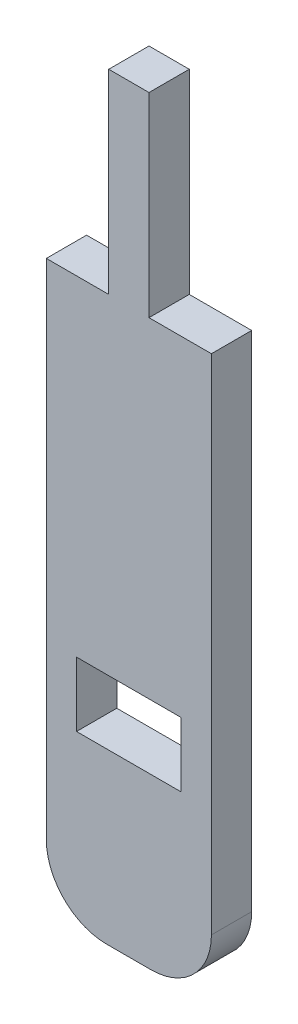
ISO-10303-21;
HEADER;
FILE_DESCRIPTION(('STEP AP214'),'2;1');
FILE_NAME('part.step','',(''),(''),'','','');
FILE_SCHEMA(('AUTOMOTIVE_DESIGN { 1 0 10303 214 1 1 1 1 }'));
ENDSEC;
DATA;
#1=APPLICATION_CONTEXT('core data for automotive mechanical design processes');
#2=APPLICATION_PROTOCOL_DEFINITION('international standard','automotive_design',2000,#1);
#3=PRODUCT_CONTEXT('',#1,'mechanical');
#4=PRODUCT('Part','Part','',(#3));
#5=PRODUCT_RELATED_PRODUCT_CATEGORY('part','',(#4));
#6=PRODUCT_DEFINITION_FORMATION('','',#4);
#7=PRODUCT_DEFINITION_CONTEXT('part definition',#1,'design');
#8=PRODUCT_DEFINITION('design','',#6,#7);
#9=PRODUCT_DEFINITION_SHAPE('','',#8);
#10=(LENGTH_UNIT() NAMED_UNIT(*) SI_UNIT(.MILLI.,.METRE.));
#11=(NAMED_UNIT(*) PLANE_ANGLE_UNIT() SI_UNIT($,.RADIAN.));
#12=(NAMED_UNIT(*) SI_UNIT($,.STERADIAN.) SOLID_ANGLE_UNIT());
#13=UNCERTAINTY_MEASURE_WITH_UNIT(LENGTH_MEASURE(1.E-05),#10,'distance_accuracy_value','');
#14=(GEOMETRIC_REPRESENTATION_CONTEXT(3) GLOBAL_UNCERTAINTY_ASSIGNED_CONTEXT((#13)) GLOBAL_UNIT_ASSIGNED_CONTEXT((#10,
#11,#12)) REPRESENTATION_CONTEXT('',''));
#15=CARTESIAN_POINT('',(0.,0.,0.));
#16=DIRECTION('',(0.,0.,1.));
#17=DIRECTION('',(1.,0.,0.));
#18=AXIS2_PLACEMENT_3D('',#15,#16,#17);
#19=CARTESIAN_POINT('',(-4.1,0.,2.));
#20=DIRECTION('',(1.,0.,0.));
#21=DIRECTION('',(0.,0.,-1.));
#22=AXIS2_PLACEMENT_3D('',#19,#20,#21);
#23=PLANE('',#22);
#24=DIRECTION('',(0.,-1.,0.));
#25=VECTOR('',#24,1.);
#26=CARTESIAN_POINT('',(-4.1,0.,0.));
#27=LINE('',#26,#25);
#28=CARTESIAN_POINT('',(-4.1,18.,0.));
#29=VERTEX_POINT('',#28);
#30=CARTESIAN_POINT('',(-4.1,-7.,0.));
#31=VERTEX_POINT('',#30);
#32=EDGE_CURVE('E186',#29,#31,#27,.T.);
#33=ORIENTED_EDGE('',*,*,#32,.T.);
#34=DIRECTION('',(0.,0.,-1.));
#35=VECTOR('',#34,1.);
#36=CARTESIAN_POINT('',(-4.1,-7.,2.));
#37=LINE('',#36,#35);
#38=CARTESIAN_POINT('',(-4.1,-7.,2.));
#39=VERTEX_POINT('',#38);
#40=EDGE_CURVE('E11',#39,#31,#37,.T.);
#41=ORIENTED_EDGE('',*,*,#40,.F.);
#42=DIRECTION('',(0.,-1.,0.));
#43=VECTOR('',#42,1.);
#44=CARTESIAN_POINT('',(-4.1,0.,2.));
#45=LINE('',#44,#43);
#46=CARTESIAN_POINT('',(-4.1,18.,2.));
#47=VERTEX_POINT('',#46);
#48=EDGE_CURVE('E299',#47,#39,#45,.T.);
#49=ORIENTED_EDGE('',*,*,#48,.F.);
#50=DIRECTION('',(0.,0.,-1.));
#51=VECTOR('',#50,1.);
#52=CARTESIAN_POINT('',(-4.1,18.,2.));
#53=LINE('',#52,#51);
#54=EDGE_CURVE('E54',#47,#29,#53,.T.);
#55=ORIENTED_EDGE('',*,*,#54,.T.);
#56=EDGE_LOOP('',(#33,#41,#49,#55));
#57=FACE_BOUND('',#56,.T.);
#58=ADVANCED_FACE('F35',(#57),#23,.F.);
#59=CARTESIAN_POINT('',(-1.1,-7.,2.));
#60=DIRECTION('',(0.,0.,-1.));
#61=DIRECTION('',(-1.,0.,0.));
#62=AXIS2_PLACEMENT_3D('',#59,#60,#61);
#63=CYLINDRICAL_SURFACE('',#62,3.);
#64=CARTESIAN_POINT('',(-1.1,-7.,0.));
#65=DIRECTION('',(0.,0.,1.));
#66=DIRECTION('',(1.,0.,0.));
#67=AXIS2_PLACEMENT_3D('',#64,#65,#66);
#68=CIRCLE('',#67,3.);
#69=CARTESIAN_POINT('',(-1.1,-10.,0.));
#70=VERTEX_POINT('',#69);
#71=EDGE_CURVE('E188',#31,#70,#68,.T.);
#72=ORIENTED_EDGE('',*,*,#71,.T.);
#73=DIRECTION('',(0.,0.,-1.));
#74=VECTOR('',#73,1.);
#75=CARTESIAN_POINT('',(-1.1,-10.,2.));
#76=LINE('',#75,#74);
#77=CARTESIAN_POINT('',(-1.1,-10.,2.));
#78=VERTEX_POINT('',#77);
#79=EDGE_CURVE('E45',#78,#70,#76,.T.);
#80=ORIENTED_EDGE('',*,*,#79,.F.);
#81=CARTESIAN_POINT('',(-1.1,-7.,2.));
#82=DIRECTION('',(0.,0.,1.));
#83=DIRECTION('',(1.,0.,0.));
#84=AXIS2_PLACEMENT_3D('',#81,#82,#83);
#85=CIRCLE('',#84,3.);
#86=EDGE_CURVE('E301',#39,#78,#85,.T.);
#87=ORIENTED_EDGE('',*,*,#86,.F.);
#88=ORIENTED_EDGE('',*,*,#40,.T.);
#89=EDGE_LOOP('',(#72,#80,#87,#88));
#90=FACE_BOUND('',#89,.T.);
#91=ADVANCED_FACE('F254',(#90),#63,.T.);
#92=CARTESIAN_POINT('',(0.,-10.,2.));
#93=DIRECTION('',(0.,1.,0.));
#94=DIRECTION('',(0.,0.,1.));
#95=AXIS2_PLACEMENT_3D('',#92,#93,#94);
#96=PLANE('',#95);
#97=DIRECTION('',(1.,0.,0.));
#98=VECTOR('',#97,1.);
#99=CARTESIAN_POINT('',(0.,-10.,0.));
#100=LINE('',#99,#98);
#101=CARTESIAN_POINT('',(1.1,-10.,0.));
#102=VERTEX_POINT('',#101);
#103=EDGE_CURVE('E190',#70,#102,#100,.T.);
#104=ORIENTED_EDGE('',*,*,#103,.T.);
#105=DIRECTION('',(0.,0.,-1.));
#106=VECTOR('',#105,1.);
#107=CARTESIAN_POINT('',(1.1,-10.,2.));
#108=LINE('',#107,#106);
#109=CARTESIAN_POINT('',(1.1,-10.,2.));
#110=VERTEX_POINT('',#109);
#111=EDGE_CURVE('E218',#110,#102,#108,.T.);
#112=ORIENTED_EDGE('',*,*,#111,.F.);
#113=DIRECTION('',(1.,0.,0.));
#114=VECTOR('',#113,1.);
#115=CARTESIAN_POINT('',(0.,-10.,2.));
#116=LINE('',#115,#114);
#117=EDGE_CURVE('E303',#78,#110,#116,.T.);
#118=ORIENTED_EDGE('',*,*,#117,.F.);
#119=ORIENTED_EDGE('',*,*,#79,.T.);
#120=EDGE_LOOP('',(#104,#112,#118,#119));
#121=FACE_BOUND('',#120,.T.);
#122=ADVANCED_FACE('F259',(#121),#96,.F.);
#123=CARTESIAN_POINT('',(1.1,-7.,2.));
#124=DIRECTION('',(0.,0.,-1.));
#125=DIRECTION('',(-1.,0.,0.));
#126=AXIS2_PLACEMENT_3D('',#123,#124,#125);
#127=CYLINDRICAL_SURFACE('',#126,3.);
#128=CARTESIAN_POINT('',(1.1,-7.,0.));
#129=DIRECTION('',(0.,0.,1.));
#130=DIRECTION('',(1.,0.,0.));
#131=AXIS2_PLACEMENT_3D('',#128,#129,#130);
#132=CIRCLE('',#131,3.);
#133=CARTESIAN_POINT('',(4.1,-7.,0.));
#134=VERTEX_POINT('',#133);
#135=EDGE_CURVE('E193',#134,#102,#132,.F.);
#136=ORIENTED_EDGE('',*,*,#135,.F.);
#137=DIRECTION('',(0.,0.,-1.));
#138=VECTOR('',#137,1.);
#139=CARTESIAN_POINT('',(4.1,-7.,2.));
#140=LINE('',#139,#138);
#141=CARTESIAN_POINT('',(4.1,-7.,2.));
#142=VERTEX_POINT('',#141);
#143=EDGE_CURVE('E216',#142,#134,#140,.T.);
#144=ORIENTED_EDGE('',*,*,#143,.F.);
#145=CARTESIAN_POINT('',(1.1,-7.,2.));
#146=DIRECTION('',(0.,0.,1.));
#147=DIRECTION('',(1.,0.,0.));
#148=AXIS2_PLACEMENT_3D('',#145,#146,#147);
#149=CIRCLE('',#148,3.);
#150=EDGE_CURVE('E305',#142,#110,#149,.F.);
#151=ORIENTED_EDGE('',*,*,#150,.T.);
#152=ORIENTED_EDGE('',*,*,#111,.T.);
#153=EDGE_LOOP('',(#136,#144,#151,#152));
#154=FACE_BOUND('',#153,.T.);
#155=ADVANCED_FACE('F265',(#154),#127,.T.);
#156=CARTESIAN_POINT('',(4.1,0.,2.));
#157=DIRECTION('',(-1.,0.,0.));
#158=DIRECTION('',(0.,0.,1.));
#159=AXIS2_PLACEMENT_3D('',#156,#157,#158);
#160=PLANE('',#159);
#161=DIRECTION('',(0.,1.,0.));
#162=VECTOR('',#161,1.);
#163=CARTESIAN_POINT('',(4.1,0.,0.));
#164=LINE('',#163,#162);
#165=CARTESIAN_POINT('',(4.1,18.,0.));
#166=VERTEX_POINT('',#165);
#167=EDGE_CURVE('E196',#134,#166,#164,.T.);
#168=ORIENTED_EDGE('',*,*,#167,.T.);
#169=DIRECTION('',(0.,0.,-1.));
#170=VECTOR('',#169,1.);
#171=CARTESIAN_POINT('',(4.1,18.,2.));
#172=LINE('',#171,#170);
#173=CARTESIAN_POINT('',(4.1,18.,2.));
#174=VERTEX_POINT('',#173);
#175=EDGE_CURVE('E214',#174,#166,#172,.T.);
#176=ORIENTED_EDGE('',*,*,#175,.F.);
#177=DIRECTION('',(0.,1.,0.));
#178=VECTOR('',#177,1.);
#179=CARTESIAN_POINT('',(4.1,0.,2.));
#180=LINE('',#179,#178);
#181=EDGE_CURVE('E308',#142,#174,#180,.T.);
#182=ORIENTED_EDGE('',*,*,#181,.F.);
#183=ORIENTED_EDGE('',*,*,#143,.T.);
#184=EDGE_LOOP('',(#168,#176,#182,#183));
#185=FACE_BOUND('',#184,.T.);
#186=ADVANCED_FACE('F269',(#185),#160,.F.);
#187=CARTESIAN_POINT('',(0.,18.,2.));
#188=DIRECTION('',(0.,1.,0.));
#189=DIRECTION('',(0.,0.,1.));
#190=AXIS2_PLACEMENT_3D('',#187,#188,#189);
#191=PLANE('',#190);
#192=DIRECTION('',(1.,0.,0.));
#193=VECTOR('',#192,1.);
#194=CARTESIAN_POINT('',(0.,18.,0.));
#195=LINE('',#194,#193);
#196=CARTESIAN_POINT('',(1.,18.,0.));
#197=VERTEX_POINT('',#196);
#198=EDGE_CURVE('E199',#197,#166,#195,.T.);
#199=ORIENTED_EDGE('',*,*,#198,.F.);
#200=DIRECTION('',(0.,0.,-1.));
#201=VECTOR('',#200,1.);
#202=CARTESIAN_POINT('',(1.,18.,2.));
#203=LINE('',#202,#201);
#204=CARTESIAN_POINT('',(1.,18.,2.));
#205=VERTEX_POINT('',#204);
#206=EDGE_CURVE('E212',#205,#197,#203,.T.);
#207=ORIENTED_EDGE('',*,*,#206,.F.);
#208=DIRECTION('',(1.,0.,0.));
#209=VECTOR('',#208,1.);
#210=CARTESIAN_POINT('',(0.,18.,2.));
#211=LINE('',#210,#209);
#212=EDGE_CURVE('E170',#205,#174,#211,.T.);
#213=ORIENTED_EDGE('',*,*,#212,.T.);
#214=ORIENTED_EDGE('',*,*,#175,.T.);
#215=EDGE_LOOP('',(#199,#207,#213,#214));
#216=FACE_BOUND('',#215,.T.);
#217=ADVANCED_FACE('F273',(#216),#191,.T.);
#218=CARTESIAN_POINT('',(1.,0.,2.));
#219=DIRECTION('',(1.,0.,0.));
#220=DIRECTION('',(0.,1.,0.));
#221=AXIS2_PLACEMENT_3D('',#218,#219,#220);
#222=PLANE('',#221);
#223=DIRECTION('',(0.,-1.,0.));
#224=VECTOR('',#223,1.);
#225=CARTESIAN_POINT('',(1.,0.,0.));
#226=LINE('',#225,#224);
#227=CARTESIAN_POINT('',(0.999999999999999,27.6857443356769,0.));
#228=VERTEX_POINT('',#227);
#229=EDGE_CURVE('E202',#228,#197,#226,.T.);
#230=ORIENTED_EDGE('',*,*,#229,.F.);
#231=DIRECTION('',(0.,0.,-1.));
#232=VECTOR('',#231,1.);
#233=CARTESIAN_POINT('',(0.999999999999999,27.6857443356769,2.));
#234=LINE('',#233,#232);
#235=CARTESIAN_POINT('',(0.999999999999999,27.6857443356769,2.));
#236=VERTEX_POINT('',#235);
#237=EDGE_CURVE('E155',#236,#228,#234,.T.);
#238=ORIENTED_EDGE('',*,*,#237,.F.);
#239=DIRECTION('',(0.,-1.,0.));
#240=VECTOR('',#239,1.);
#241=CARTESIAN_POINT('',(1.,0.,2.));
#242=LINE('',#241,#240);
#243=EDGE_CURVE('E168',#236,#205,#242,.T.);
#244=ORIENTED_EDGE('',*,*,#243,.T.);
#245=ORIENTED_EDGE('',*,*,#206,.T.);
#246=EDGE_LOOP('',(#230,#238,#244,#245));
#247=FACE_BOUND('',#246,.T.);
#248=ADVANCED_FACE('F275',(#247),#222,.T.);
#249=CARTESIAN_POINT('',(0.,27.6857443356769,2.));
#250=DIRECTION('',(0.,1.,0.));
#251=DIRECTION('',(0.,0.,1.));
#252=AXIS2_PLACEMENT_3D('',#249,#250,#251);
#253=PLANE('',#252);
#254=DIRECTION('',(1.,0.,0.));
#255=VECTOR('',#254,1.);
#256=CARTESIAN_POINT('',(0.,27.6857443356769,0.));
#257=LINE('',#256,#255);
#258=CARTESIAN_POINT('',(-0.999999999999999,27.6857443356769,0.));
#259=VERTEX_POINT('',#258);
#260=EDGE_CURVE('E152',#259,#228,#257,.T.);
#261=ORIENTED_EDGE('',*,*,#260,.F.);
#262=DIRECTION('',(0.,0.,-1.));
#263=VECTOR('',#262,1.);
#264=CARTESIAN_POINT('',(-0.999999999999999,27.6857443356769,2.));
#265=LINE('',#264,#263);
#266=CARTESIAN_POINT('',(-0.999999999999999,27.6857443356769,2.));
#267=VERTEX_POINT('',#266);
#268=EDGE_CURVE('E146',#267,#259,#265,.T.);
#269=ORIENTED_EDGE('',*,*,#268,.F.);
#270=DIRECTION('',(1.,0.,0.));
#271=VECTOR('',#270,1.);
#272=CARTESIAN_POINT('',(0.,27.6857443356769,2.));
#273=LINE('',#272,#271);
#274=EDGE_CURVE('E150',#267,#236,#273,.T.);
#275=ORIENTED_EDGE('',*,*,#274,.T.);
#276=ORIENTED_EDGE('',*,*,#237,.T.);
#277=EDGE_LOOP('',(#261,#269,#275,#276));
#278=FACE_BOUND('',#277,.T.);
#279=ADVANCED_FACE('F148',(#278),#253,.T.);
#280=CARTESIAN_POINT('',(-1.,0.,2.));
#281=DIRECTION('',(1.,0.,0.));
#282=DIRECTION('',(0.,1.,0.));
#283=AXIS2_PLACEMENT_3D('',#280,#281,#282);
#284=PLANE('',#283);
#285=DIRECTION('',(0.,-1.,0.));
#286=VECTOR('',#285,1.);
#287=CARTESIAN_POINT('',(-1.,0.,0.));
#288=LINE('',#287,#286);
#289=CARTESIAN_POINT('',(-0.999999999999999,18.,0.));
#290=VERTEX_POINT('',#289);
#291=EDGE_CURVE('E207',#259,#290,#288,.T.);
#292=ORIENTED_EDGE('',*,*,#291,.T.);
#293=DIRECTION('',(0.,0.,-1.));
#294=VECTOR('',#293,1.);
#295=CARTESIAN_POINT('',(-0.999999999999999,18.,2.));
#296=LINE('',#295,#294);
#297=CARTESIAN_POINT('',(-0.999999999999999,18.,2.));
#298=VERTEX_POINT('',#297);
#299=EDGE_CURVE('E99',#298,#290,#296,.T.);
#300=ORIENTED_EDGE('',*,*,#299,.F.);
#301=DIRECTION('',(0.,-1.,0.));
#302=VECTOR('',#301,1.);
#303=CARTESIAN_POINT('',(-1.,0.,2.));
#304=LINE('',#303,#302);
#305=EDGE_CURVE('E157',#267,#298,#304,.T.);
#306=ORIENTED_EDGE('',*,*,#305,.F.);
#307=ORIENTED_EDGE('',*,*,#268,.T.);
#308=EDGE_LOOP('',(#292,#300,#306,#307));
#309=FACE_BOUND('',#308,.T.);
#310=ADVANCED_FACE('F158',(#309),#284,.F.);
#311=CARTESIAN_POINT('',(0.,1.6,2.));
#312=DIRECTION('',(0.,1.,0.));
#313=DIRECTION('',(0.,0.,1.));
#314=AXIS2_PLACEMENT_3D('',#311,#312,#313);
#315=PLANE('',#314);
#316=DIRECTION('',(1.,0.,0.));
#317=VECTOR('',#316,1.);
#318=CARTESIAN_POINT('',(0.,1.6,0.));
#319=LINE('',#318,#317);
#320=CARTESIAN_POINT('',(-2.6,1.6,0.));
#321=VERTEX_POINT('',#320);
#322=CARTESIAN_POINT('',(2.6,1.6,0.));
#323=VERTEX_POINT('',#322);
#324=EDGE_CURVE('E174',#321,#323,#319,.T.);
#325=ORIENTED_EDGE('',*,*,#324,.T.);
#326=DIRECTION('',(0.,0.,-1.));
#327=VECTOR('',#326,1.);
#328=CARTESIAN_POINT('',(2.6,1.6,2.));
#329=LINE('',#328,#327);
#330=CARTESIAN_POINT('',(2.6,1.6,2.));
#331=VERTEX_POINT('',#330);
#332=EDGE_CURVE('E39',#331,#323,#329,.T.);
#333=ORIENTED_EDGE('',*,*,#332,.F.);
#334=DIRECTION('',(1.,0.,0.));
#335=VECTOR('',#334,1.);
#336=CARTESIAN_POINT('',(0.,1.6,2.));
#337=LINE('',#336,#335);
#338=CARTESIAN_POINT('',(-2.6,1.6,2.));
#339=VERTEX_POINT('',#338);
#340=EDGE_CURVE('E291',#339,#331,#337,.T.);
#341=ORIENTED_EDGE('',*,*,#340,.F.);
#342=DIRECTION('',(0.,0.,-1.));
#343=VECTOR('',#342,1.);
#344=CARTESIAN_POINT('',(-2.6,1.6,2.));
#345=LINE('',#344,#343);
#346=EDGE_CURVE('E222',#339,#321,#345,.T.);
#347=ORIENTED_EDGE('',*,*,#346,.T.);
#348=EDGE_LOOP('',(#325,#333,#341,#347));
#349=FACE_BOUND('',#348,.T.);
#350=ADVANCED_FACE('F37',(#349),#315,.F.);
#351=CARTESIAN_POINT('',(2.6,0.,2.));
#352=DIRECTION('',(1.,0.,0.));
#353=DIRECTION('',(0.,0.,-1.));
#354=AXIS2_PLACEMENT_3D('',#351,#352,#353);
#355=PLANE('',#354);
#356=DIRECTION('',(0.,-1.,0.));
#357=VECTOR('',#356,1.);
#358=CARTESIAN_POINT('',(2.6,0.,0.));
#359=LINE('',#358,#357);
#360=CARTESIAN_POINT('',(2.6,-1.6,0.));
#361=VERTEX_POINT('',#360);
#362=EDGE_CURVE('E177',#323,#361,#359,.T.);
#363=ORIENTED_EDGE('',*,*,#362,.T.);
#364=DIRECTION('',(0.,0.,-1.));
#365=VECTOR('',#364,1.);
#366=CARTESIAN_POINT('',(2.6,-1.6,2.));
#367=LINE('',#366,#365);
#368=CARTESIAN_POINT('',(2.6,-1.6,2.));
#369=VERTEX_POINT('',#368);
#370=EDGE_CURVE('E225',#369,#361,#367,.T.);
#371=ORIENTED_EDGE('',*,*,#370,.F.);
#372=DIRECTION('',(0.,-1.,0.));
#373=VECTOR('',#372,1.);
#374=CARTESIAN_POINT('',(2.6,0.,2.));
#375=LINE('',#374,#373);
#376=EDGE_CURVE('E112',#331,#369,#375,.T.);
#377=ORIENTED_EDGE('',*,*,#376,.F.);
#378=ORIENTED_EDGE('',*,*,#332,.T.);
#379=EDGE_LOOP('',(#363,#371,#377,#378));
#380=FACE_BOUND('',#379,.T.);
#381=ADVANCED_FACE('F230',(#380),#355,.F.);
#382=CARTESIAN_POINT('',(0.,-1.6,2.));
#383=DIRECTION('',(0.,1.,0.));
#384=DIRECTION('',(0.,0.,1.));
#385=AXIS2_PLACEMENT_3D('',#382,#383,#384);
#386=PLANE('',#385);
#387=DIRECTION('',(1.,0.,0.));
#388=VECTOR('',#387,1.);
#389=CARTESIAN_POINT('',(0.,-1.6,0.));
#390=LINE('',#389,#388);
#391=CARTESIAN_POINT('',(-2.6,-1.6,0.));
#392=VERTEX_POINT('',#391);
#393=EDGE_CURVE('E180',#392,#361,#390,.T.);
#394=ORIENTED_EDGE('',*,*,#393,.F.);
#395=DIRECTION('',(0.,0.,-1.));
#396=VECTOR('',#395,1.);
#397=CARTESIAN_POINT('',(-2.6,-1.6,2.));
#398=LINE('',#397,#396);
#399=CARTESIAN_POINT('',(-2.6,-1.6,2.));
#400=VERTEX_POINT('',#399);
#401=EDGE_CURVE('E224',#400,#392,#398,.T.);
#402=ORIENTED_EDGE('',*,*,#401,.F.);
#403=DIRECTION('',(1.,0.,0.));
#404=VECTOR('',#403,1.);
#405=CARTESIAN_POINT('',(0.,-1.6,2.));
#406=LINE('',#405,#404);
#407=EDGE_CURVE('E293',#400,#369,#406,.T.);
#408=ORIENTED_EDGE('',*,*,#407,.T.);
#409=ORIENTED_EDGE('',*,*,#370,.T.);
#410=EDGE_LOOP('',(#394,#402,#408,#409));
#411=FACE_BOUND('',#410,.T.);
#412=ADVANCED_FACE('F244',(#411),#386,.T.);
#413=CARTESIAN_POINT('',(-2.6,0.,2.));
#414=DIRECTION('',(1.,0.,0.));
#415=DIRECTION('',(0.,0.,-1.));
#416=AXIS2_PLACEMENT_3D('',#413,#414,#415);
#417=PLANE('',#416);
#418=DIRECTION('',(0.,-1.,0.));
#419=VECTOR('',#418,1.);
#420=CARTESIAN_POINT('',(-2.6,0.,0.));
#421=LINE('',#420,#419);
#422=EDGE_CURVE('E183',#321,#392,#421,.T.);
#423=ORIENTED_EDGE('',*,*,#422,.F.);
#424=ORIENTED_EDGE('',*,*,#346,.F.);
#425=DIRECTION('',(0.,-1.,0.));
#426=VECTOR('',#425,1.);
#427=CARTESIAN_POINT('',(-2.6,0.,2.));
#428=LINE('',#427,#426);
#429=EDGE_CURVE('E242',#339,#400,#428,.T.);
#430=ORIENTED_EDGE('',*,*,#429,.T.);
#431=ORIENTED_EDGE('',*,*,#401,.T.);
#432=EDGE_LOOP('',(#423,#424,#430,#431));
#433=FACE_BOUND('',#432,.T.);
#434=ADVANCED_FACE('F239',(#433),#417,.T.);
#435=EDGE_CURVE('E203',#29,#290,#195,.T.);
#436=ORIENTED_EDGE('',*,*,#435,.F.);
#437=ORIENTED_EDGE('',*,*,#54,.F.);
#438=EDGE_CURVE('E161',#47,#298,#211,.T.);
#439=ORIENTED_EDGE('',*,*,#438,.T.);
#440=ORIENTED_EDGE('',*,*,#299,.T.);
#441=EDGE_LOOP('',(#436,#437,#439,#440));
#442=FACE_BOUND('',#441,.T.);
#443=ADVANCED_FACE('F251',(#442),#191,.T.);
#444=CARTESIAN_POINT('',(0.,0.,2.));
#445=DIRECTION('',(0.,0.,1.));
#446=DIRECTION('',(1.,0.,0.));
#447=AXIS2_PLACEMENT_3D('',#444,#445,#446);
#448=PLANE('',#447);
#449=ORIENTED_EDGE('',*,*,#340,.T.);
#450=ORIENTED_EDGE('',*,*,#376,.T.);
#451=ORIENTED_EDGE('',*,*,#407,.F.);
#452=ORIENTED_EDGE('',*,*,#429,.F.);
#453=EDGE_LOOP('',(#449,#450,#451,#452));
#454=FACE_BOUND('',#453,.T.);
#455=ORIENTED_EDGE('',*,*,#48,.T.);
#456=ORIENTED_EDGE('',*,*,#86,.T.);
#457=ORIENTED_EDGE('',*,*,#117,.T.);
#458=ORIENTED_EDGE('',*,*,#150,.F.);
#459=ORIENTED_EDGE('',*,*,#181,.T.);
#460=ORIENTED_EDGE('',*,*,#212,.F.);
#461=ORIENTED_EDGE('',*,*,#243,.F.);
#462=ORIENTED_EDGE('',*,*,#274,.F.);
#463=ORIENTED_EDGE('',*,*,#305,.T.);
#464=ORIENTED_EDGE('',*,*,#438,.F.);
#465=EDGE_LOOP('',(#455,#456,#457,#458,#459,#460,#461,#462,#463,#464));
#466=FACE_BOUND('',#465,.T.);
#467=ADVANCED_FACE('F165',(#454,#466),#448,.T.);
#468=CARTESIAN_POINT('',(0.,0.,0.));
#469=DIRECTION('',(0.,0.,1.));
#470=DIRECTION('',(1.,0.,0.));
#471=AXIS2_PLACEMENT_3D('',#468,#469,#470);
#472=PLANE('',#471);
#473=ORIENTED_EDGE('',*,*,#324,.F.);
#474=ORIENTED_EDGE('',*,*,#422,.T.);
#475=ORIENTED_EDGE('',*,*,#393,.T.);
#476=ORIENTED_EDGE('',*,*,#362,.F.);
#477=EDGE_LOOP('',(#473,#474,#475,#476));
#478=FACE_BOUND('',#477,.T.);
#479=ORIENTED_EDGE('',*,*,#32,.F.);
#480=ORIENTED_EDGE('',*,*,#435,.T.);
#481=ORIENTED_EDGE('',*,*,#291,.F.);
#482=ORIENTED_EDGE('',*,*,#260,.T.);
#483=ORIENTED_EDGE('',*,*,#229,.T.);
#484=ORIENTED_EDGE('',*,*,#198,.T.);
#485=ORIENTED_EDGE('',*,*,#167,.F.);
#486=ORIENTED_EDGE('',*,*,#135,.T.);
#487=ORIENTED_EDGE('',*,*,#103,.F.);
#488=ORIENTED_EDGE('',*,*,#71,.F.);
#489=EDGE_LOOP('',(#479,#480,#481,#482,#483,#484,#485,#486,#487,#488));
#490=FACE_BOUND('',#489,.T.);
#491=ADVANCED_FACE('F236',(#478,#490),#472,.F.);
#492=CLOSED_SHELL('',(#58,#91,#122,#155,#186,#217,#248,#279,#310,#350,#381,#412,#434,#443,#467,#491));
#493=MANIFOLD_SOLID_BREP('B2',#492);
#494=ADVANCED_BREP_SHAPE_REPRESENTATION('',(#18,#493),#14);
#495=SHAPE_DEFINITION_REPRESENTATION(#9,#494);
ENDSEC;
END-ISO-10303-21;
